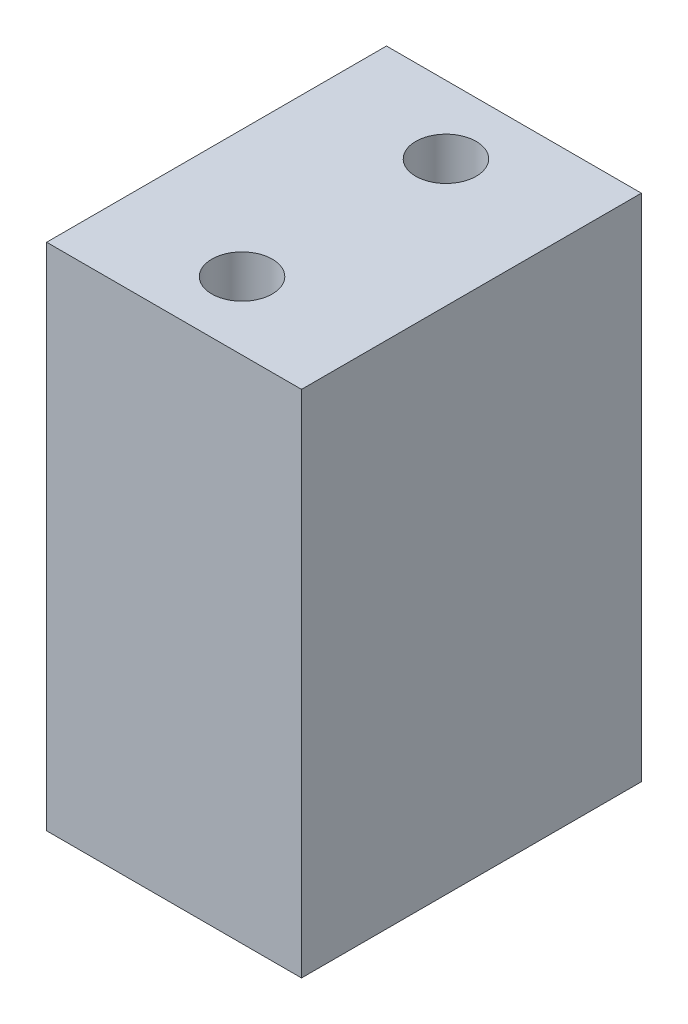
from build123d import *

# Parameters (mm, degrees)
SKETCH1_W                 = 9.525
SKETCH1_H                 = 19.05
BOSS_EXTRUDE1_DEPTH       = 12.7
F_4_40_TAPPED_HOLE1_D     = 2.2606
F_4_40_TAPPED_HOLE1_DEPTH = 7.62
F_4_40_TAPPED_HOLE1_TIP   = 0.679152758
F_4_40_TAPPED_HOLE2_D     = 2.2606
F_4_40_TAPPED_HOLE2_DEPTH = 7.62
F_4_40_TAPPED_HOLE2_TIP   = 0.679152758


with BuildPart() as part:
    # Sketch1 → Boss-Extrude1 (new body)
    with BuildSketch(Plane.XY):
        with Locations((4.7625, 9.525)):
            Rectangle(SKETCH1_W, SKETCH1_H)
    extrude(amount=BOSS_EXTRUDE1_DEPTH)

    # 4-40 Tapped Hole1
    with Locations(Plane(origin=(0, 19.05, 0), x_dir=(1, 0, 0), z_dir=(0, 1, 0))):
        with Locations((4.7625, -10.16), (4.7625, -2.54)):
            Hole(F_4_40_TAPPED_HOLE1_D / 2, depth=F_4_40_TAPPED_HOLE1_DEPTH)
            with Locations((0, 0, -(F_4_40_TAPPED_HOLE1_DEPTH + F_4_40_TAPPED_HOLE1_TIP / 2))):  # 118° drill point
                Cone(0, F_4_40_TAPPED_HOLE1_D / 2, F_4_40_TAPPED_HOLE1_TIP, mode=Mode.SUBTRACT)

    # 4-40 Tapped Hole2
    with Locations(Plane.XZ):
        with Locations((4.7625, 10.795), (4.7625, 1.905)):
            Hole(F_4_40_TAPPED_HOLE2_D / 2, depth=F_4_40_TAPPED_HOLE2_DEPTH)
            with Locations((0, 0, -(F_4_40_TAPPED_HOLE2_DEPTH + F_4_40_TAPPED_HOLE2_TIP / 2))):  # 118° drill point
                Cone(0, F_4_40_TAPPED_HOLE2_D / 2, F_4_40_TAPPED_HOLE2_TIP, mode=Mode.SUBTRACT)


solid = part.part
